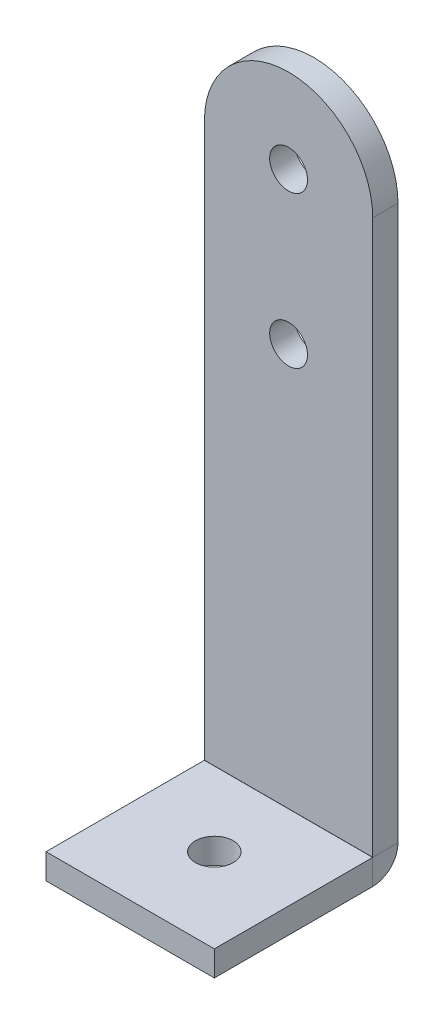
ISO-10303-21;
HEADER;
FILE_DESCRIPTION(('STEP AP214'),'2;1');
FILE_NAME('part.step','',(''),(''),'','','');
FILE_SCHEMA(('AUTOMOTIVE_DESIGN { 1 0 10303 214 1 1 1 1 }'));
ENDSEC;
DATA;
#1=APPLICATION_CONTEXT('core data for automotive mechanical design processes');
#2=APPLICATION_PROTOCOL_DEFINITION('international standard','automotive_design',2000,#1);
#3=PRODUCT_CONTEXT('',#1,'mechanical');
#4=PRODUCT('Part','Part','',(#3));
#5=PRODUCT_RELATED_PRODUCT_CATEGORY('part','',(#4));
#6=PRODUCT_DEFINITION_FORMATION('','',#4);
#7=PRODUCT_DEFINITION_CONTEXT('part definition',#1,'design');
#8=PRODUCT_DEFINITION('design','',#6,#7);
#9=PRODUCT_DEFINITION_SHAPE('','',#8);
#10=(LENGTH_UNIT() NAMED_UNIT(*) SI_UNIT(.MILLI.,.METRE.));
#11=(NAMED_UNIT(*) PLANE_ANGLE_UNIT() SI_UNIT($,.RADIAN.));
#12=(NAMED_UNIT(*) SI_UNIT($,.STERADIAN.) SOLID_ANGLE_UNIT());
#13=UNCERTAINTY_MEASURE_WITH_UNIT(LENGTH_MEASURE(1.E-05),#10,'distance_accuracy_value','');
#14=(GEOMETRIC_REPRESENTATION_CONTEXT(3) GLOBAL_UNCERTAINTY_ASSIGNED_CONTEXT((#13)) GLOBAL_UNIT_ASSIGNED_CONTEXT((#10,
#11,#12)) REPRESENTATION_CONTEXT('',''));
#15=CARTESIAN_POINT('',(0.,0.,0.));
#16=DIRECTION('',(0.,0.,1.));
#17=DIRECTION('',(1.,0.,0.));
#18=AXIS2_PLACEMENT_3D('',#15,#16,#17);
#19=CARTESIAN_POINT('',(10.,21.1759512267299,-65.1759512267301));
#20=DIRECTION('',(0.,1.,0.));
#21=DIRECTION('',(1.,0.,0.));
#22=AXIS2_PLACEMENT_3D('',#19,#20,#21);
#23=PLANE('',#22);
#24=CARTESIAN_POINT('',(10.,21.1759512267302,11.8240487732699));
#25=DIRECTION('',(0.,1.,0.));
#26=DIRECTION('',(1.,0.,0.));
#27=AXIS2_PLACEMENT_3D('',#24,#25,#26);
#28=CIRCLE('',#27,2.25);
#29=CARTESIAN_POINT('',(12.25,21.1759512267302,11.8240487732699));
#30=VERTEX_POINT('',#29);
#31=EDGE_CURVE('E143',#30,#30,#28,.T.);
#32=ORIENTED_EDGE('',*,*,#31,.F.);
#33=EDGE_LOOP('',(#32));
#34=FACE_BOUND('',#33,.T.);
#35=DIRECTION('',(0.,0.,-1.));
#36=VECTOR('',#35,1.);
#37=CARTESIAN_POINT('',(20.,21.1759512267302,21.8240487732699));
#38=LINE('',#37,#36);
#39=CARTESIAN_POINT('',(20.,21.1759512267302,21.8240487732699));
#40=VERTEX_POINT('',#39);
#41=CARTESIAN_POINT('',(20.,21.1759512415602,3.01));
#42=VERTEX_POINT('',#41);
#43=EDGE_CURVE('E40',#40,#42,#38,.T.);
#44=ORIENTED_EDGE('',*,*,#43,.T.);
#45=DIRECTION('',(-1.,0.,0.));
#46=VECTOR('',#45,1.);
#47=CARTESIAN_POINT('',(10.,21.1759512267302,3.01000000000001));
#48=LINE('',#47,#46);
#49=CARTESIAN_POINT('',(0.,21.1759512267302,3.01));
#50=VERTEX_POINT('',#49);
#51=EDGE_CURVE('E113',#42,#50,#48,.T.);
#52=ORIENTED_EDGE('',*,*,#51,.T.);
#53=DIRECTION('',(0.,0.,1.));
#54=VECTOR('',#53,1.);
#55=CARTESIAN_POINT('',(0.,21.1759512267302,21.8240487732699));
#56=LINE('',#55,#54);
#57=CARTESIAN_POINT('',(0.,21.1759512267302,21.8240487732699));
#58=VERTEX_POINT('',#57);
#59=EDGE_CURVE('E132',#50,#58,#56,.T.);
#60=ORIENTED_EDGE('',*,*,#59,.T.);
#61=DIRECTION('',(1.,0.,0.));
#62=VECTOR('',#61,1.);
#63=CARTESIAN_POINT('',(0.,21.1759512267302,21.8240487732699));
#64=LINE('',#63,#62);
#65=EDGE_CURVE('E60',#58,#40,#64,.T.);
#66=ORIENTED_EDGE('',*,*,#65,.T.);
#67=EDGE_LOOP('',(#44,#52,#60,#66));
#68=FACE_BOUND('',#67,.T.);
#69=ADVANCED_FACE('F36',(#34,#68),#23,.T.);
#70=CARTESIAN_POINT('',(10.,18.1759512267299,-65.1759512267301));
#71=DIRECTION('',(0.,1.,0.));
#72=DIRECTION('',(1.,0.,0.));
#73=AXIS2_PLACEMENT_3D('',#70,#71,#72);
#74=PLANE('',#73);
#75=DIRECTION('',(-1.,0.,0.));
#76=VECTOR('',#75,1.);
#77=CARTESIAN_POINT('',(10.,18.1759512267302,3.01));
#78=LINE('',#77,#76);
#79=CARTESIAN_POINT('',(20.,18.1759512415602,3.01));
#80=VERTEX_POINT('',#79);
#81=CARTESIAN_POINT('',(0.,18.1759512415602,3.01));
#82=VERTEX_POINT('',#81);
#83=EDGE_CURVE('E45',#80,#82,#78,.T.);
#84=ORIENTED_EDGE('',*,*,#83,.F.);
#85=DIRECTION('',(0.,0.,-1.));
#86=VECTOR('',#85,1.);
#87=CARTESIAN_POINT('',(20.,18.1759512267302,21.8240487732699));
#88=LINE('',#87,#86);
#89=CARTESIAN_POINT('',(20.,18.1759512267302,21.8240487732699));
#90=VERTEX_POINT('',#89);
#91=EDGE_CURVE('E127',#90,#80,#88,.T.);
#92=ORIENTED_EDGE('',*,*,#91,.F.);
#93=DIRECTION('',(1.,0.,0.));
#94=VECTOR('',#93,1.);
#95=CARTESIAN_POINT('',(0.,18.1759512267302,21.8240487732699));
#96=LINE('',#95,#94);
#97=CARTESIAN_POINT('',(0.,18.1759512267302,21.8240487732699));
#98=VERTEX_POINT('',#97);
#99=EDGE_CURVE('E133',#98,#90,#96,.T.);
#100=ORIENTED_EDGE('',*,*,#99,.F.);
#101=DIRECTION('',(0.,0.,1.));
#102=VECTOR('',#101,1.);
#103=CARTESIAN_POINT('',(0.,18.1759512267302,21.8240487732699));
#104=LINE('',#103,#102);
#105=EDGE_CURVE('E138',#82,#98,#104,.T.);
#106=ORIENTED_EDGE('',*,*,#105,.F.);
#107=EDGE_LOOP('',(#84,#92,#100,#106));
#108=FACE_BOUND('',#107,.T.);
#109=CARTESIAN_POINT('',(10.,18.1759512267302,11.8240487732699));
#110=DIRECTION('',(0.,1.,0.));
#111=DIRECTION('',(1.,0.,0.));
#112=AXIS2_PLACEMENT_3D('',#109,#110,#111);
#113=CIRCLE('',#112,2.25);
#114=CARTESIAN_POINT('',(12.25,18.1759512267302,11.8240487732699));
#115=VERTEX_POINT('',#114);
#116=EDGE_CURVE('E175',#115,#115,#113,.T.);
#117=ORIENTED_EDGE('',*,*,#116,.T.);
#118=EDGE_LOOP('',(#117));
#119=FACE_BOUND('',#118,.T.);
#120=ADVANCED_FACE('F136',(#108,#119),#74,.F.);
#121=CARTESIAN_POINT('',(0.,21.1759512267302,21.8240487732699));
#122=DIRECTION('',(1.,0.,0.));
#123=DIRECTION('',(0.,0.,-1.));
#124=AXIS2_PLACEMENT_3D('',#121,#122,#123);
#125=PLANE('',#124);
#126=DIRECTION('',(0.,1.,0.));
#127=VECTOR('',#126,1.);
#128=CARTESIAN_POINT('',(0.,21.1759512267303,3.01000000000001));
#129=LINE('',#128,#127);
#130=EDGE_CURVE('E12',#82,#50,#129,.T.);
#131=ORIENTED_EDGE('',*,*,#130,.F.);
#132=ORIENTED_EDGE('',*,*,#105,.T.);
#133=DIRECTION('',(0.,-1.,0.));
#134=VECTOR('',#133,1.);
#135=CARTESIAN_POINT('',(0.,21.1759512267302,21.8240487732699));
#136=LINE('',#135,#134);
#137=EDGE_CURVE('E151',#58,#98,#136,.T.);
#138=ORIENTED_EDGE('',*,*,#137,.F.);
#139=ORIENTED_EDGE('',*,*,#59,.F.);
#140=EDGE_LOOP('',(#131,#132,#138,#139));
#141=FACE_BOUND('',#140,.T.);
#142=ADVANCED_FACE('F38',(#141),#125,.F.);
#143=CARTESIAN_POINT('',(0.,21.1759512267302,21.8240487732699));
#144=DIRECTION('',(0.,0.,-1.));
#145=DIRECTION('',(0.,1.,0.));
#146=AXIS2_PLACEMENT_3D('',#143,#144,#145);
#147=PLANE('',#146);
#148=ORIENTED_EDGE('',*,*,#99,.T.);
#149=DIRECTION('',(0.,-1.,0.));
#150=VECTOR('',#149,1.);
#151=CARTESIAN_POINT('',(20.,21.1759512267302,21.8240487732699));
#152=LINE('',#151,#150);
#153=EDGE_CURVE('E129',#40,#90,#152,.T.);
#154=ORIENTED_EDGE('',*,*,#153,.F.);
#155=ORIENTED_EDGE('',*,*,#65,.F.);
#156=ORIENTED_EDGE('',*,*,#137,.T.);
#157=EDGE_LOOP('',(#148,#154,#155,#156));
#158=FACE_BOUND('',#157,.T.);
#159=ADVANCED_FACE('F156',(#158),#147,.F.);
#160=CARTESIAN_POINT('',(20.,21.1759512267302,21.8240487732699));
#161=DIRECTION('',(-1.,0.,0.));
#162=DIRECTION('',(0.,0.,1.));
#163=AXIS2_PLACEMENT_3D('',#160,#161,#162);
#164=PLANE('',#163);
#165=DIRECTION('',(0.,-1.,0.));
#166=VECTOR('',#165,1.);
#167=CARTESIAN_POINT('',(20.,21.1759512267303,3.01000000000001));
#168=LINE('',#167,#166);
#169=EDGE_CURVE('E103',#42,#80,#168,.T.);
#170=ORIENTED_EDGE('',*,*,#169,.F.);
#171=ORIENTED_EDGE('',*,*,#43,.F.);
#172=ORIENTED_EDGE('',*,*,#153,.T.);
#173=ORIENTED_EDGE('',*,*,#91,.T.);
#174=EDGE_LOOP('',(#170,#171,#172,#173));
#175=FACE_BOUND('',#174,.T.);
#176=ADVANCED_FACE('F128',(#175),#164,.F.);
#177=CARTESIAN_POINT('',(10.,21.1759512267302,11.8240487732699));
#178=DIRECTION('',(0.,-1.,0.));
#179=DIRECTION('',(-1.,0.,0.));
#180=AXIS2_PLACEMENT_3D('',#177,#178,#179);
#181=CYLINDRICAL_SURFACE('',#180,2.25);
#182=ORIENTED_EDGE('',*,*,#31,.T.);
#183=EDGE_LOOP('',(#182));
#184=FACE_BOUND('',#183,.T.);
#185=ORIENTED_EDGE('',*,*,#116,.F.);
#186=EDGE_LOOP('',(#185));
#187=FACE_BOUND('',#186,.T.);
#188=ADVANCED_FACE('F163',(#184,#187),#181,.F.);
#189=CARTESIAN_POINT('',(10.,69.,3.));
#190=DIRECTION('',(0.,0.,-1.));
#191=DIRECTION('',(-1.,0.,0.));
#192=AXIS2_PLACEMENT_3D('',#189,#190,#191);
#193=CYLINDRICAL_SURFACE('',#192,2.25);
#194=CARTESIAN_POINT('',(10.,69.,3.));
#195=DIRECTION('',(0.,0.,1.));
#196=DIRECTION('',(1.,0.,0.));
#197=AXIS2_PLACEMENT_3D('',#194,#195,#196);
#198=CIRCLE('',#197,2.25);
#199=CARTESIAN_POINT('',(12.25,69.,3.));
#200=VERTEX_POINT('',#199);
#201=EDGE_CURVE('E182',#200,#200,#198,.T.);
#202=ORIENTED_EDGE('',*,*,#201,.T.);
#203=EDGE_LOOP('',(#202));
#204=FACE_BOUND('',#203,.T.);
#205=CARTESIAN_POINT('',(10.,69.,0.));
#206=DIRECTION('',(0.,0.,1.));
#207=DIRECTION('',(1.,0.,0.));
#208=AXIS2_PLACEMENT_3D('',#205,#206,#207);
#209=CIRCLE('',#208,2.25);
#210=CARTESIAN_POINT('',(12.25,69.,0.));
#211=VERTEX_POINT('',#210);
#212=EDGE_CURVE('E205',#211,#211,#209,.T.);
#213=ORIENTED_EDGE('',*,*,#212,.F.);
#214=EDGE_LOOP('',(#213));
#215=FACE_BOUND('',#214,.T.);
#216=ADVANCED_FACE('F252',(#204,#215),#193,.F.);
#217=CARTESIAN_POINT('',(10.,87.,3.));
#218=DIRECTION('',(0.,0.,-1.));
#219=DIRECTION('',(-1.,0.,0.));
#220=AXIS2_PLACEMENT_3D('',#217,#218,#219);
#221=CYLINDRICAL_SURFACE('',#220,2.25);
#222=CARTESIAN_POINT('',(10.,87.,3.));
#223=DIRECTION('',(0.,0.,1.));
#224=DIRECTION('',(1.,0.,0.));
#225=AXIS2_PLACEMENT_3D('',#222,#223,#224);
#226=CIRCLE('',#225,2.25);
#227=CARTESIAN_POINT('',(12.25,87.,3.));
#228=VERTEX_POINT('',#227);
#229=EDGE_CURVE('E185',#228,#228,#226,.T.);
#230=ORIENTED_EDGE('',*,*,#229,.T.);
#231=EDGE_LOOP('',(#230));
#232=FACE_BOUND('',#231,.T.);
#233=CARTESIAN_POINT('',(10.,87.,0.));
#234=DIRECTION('',(0.,0.,1.));
#235=DIRECTION('',(1.,0.,0.));
#236=AXIS2_PLACEMENT_3D('',#233,#234,#235);
#237=CIRCLE('',#236,2.25);
#238=CARTESIAN_POINT('',(12.25,87.,0.));
#239=VERTEX_POINT('',#238);
#240=EDGE_CURVE('E208',#239,#239,#237,.T.);
#241=ORIENTED_EDGE('',*,*,#240,.F.);
#242=EDGE_LOOP('',(#241));
#243=FACE_BOUND('',#242,.T.);
#244=ADVANCED_FACE('F245',(#232,#243),#221,.F.);
#245=CARTESIAN_POINT('',(10.,87.,3.));
#246=DIRECTION('',(0.,0.,-1.));
#247=DIRECTION('',(-1.,0.,0.));
#248=AXIS2_PLACEMENT_3D('',#245,#246,#247);
#249=CYLINDRICAL_SURFACE('',#248,10.);
#250=CARTESIAN_POINT('',(10.,87.,0.));
#251=DIRECTION('',(0.,0.,1.));
#252=DIRECTION('',(1.,0.,0.));
#253=AXIS2_PLACEMENT_3D('',#250,#251,#252);
#254=CIRCLE('',#253,10.);
#255=CARTESIAN_POINT('',(20.,87.,0.));
#256=VERTEX_POINT('',#255);
#257=CARTESIAN_POINT('',(0.,87.,0.));
#258=VERTEX_POINT('',#257);
#259=EDGE_CURVE('E188',#256,#258,#254,.T.);
#260=ORIENTED_EDGE('',*,*,#259,.T.);
#261=DIRECTION('',(0.,0.,-1.));
#262=VECTOR('',#261,1.);
#263=CARTESIAN_POINT('',(0.,87.,3.));
#264=LINE('',#263,#262);
#265=CARTESIAN_POINT('',(0.,87.,3.));
#266=VERTEX_POINT('',#265);
#267=EDGE_CURVE('E177',#266,#258,#264,.T.);
#268=ORIENTED_EDGE('',*,*,#267,.F.);
#269=CARTESIAN_POINT('',(10.,87.,3.));
#270=DIRECTION('',(0.,0.,1.));
#271=DIRECTION('',(1.,0.,0.));
#272=AXIS2_PLACEMENT_3D('',#269,#270,#271);
#273=CIRCLE('',#272,10.);
#274=CARTESIAN_POINT('',(20.,87.,3.));
#275=VERTEX_POINT('',#274);
#276=EDGE_CURVE('E195',#275,#266,#273,.T.);
#277=ORIENTED_EDGE('',*,*,#276,.F.);
#278=DIRECTION('',(0.,0.,-1.));
#279=VECTOR('',#278,1.);
#280=CARTESIAN_POINT('',(20.,87.,3.));
#281=LINE('',#280,#279);
#282=EDGE_CURVE('E190',#275,#256,#281,.T.);
#283=ORIENTED_EDGE('',*,*,#282,.T.);
#284=EDGE_LOOP('',(#260,#268,#277,#283));
#285=FACE_BOUND('',#284,.T.);
#286=ADVANCED_FACE('F243',(#285),#249,.T.);
#287=CARTESIAN_POINT('',(10.,87.,3.));
#288=DIRECTION('',(0.,0.,1.));
#289=DIRECTION('',(1.,0.,0.));
#290=AXIS2_PLACEMENT_3D('',#287,#288,#289);
#291=PLANE('',#290);
#292=DIRECTION('',(-1.,0.,0.));
#293=VECTOR('',#292,1.);
#294=CARTESIAN_POINT('',(10.,21.1859512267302,3.));
#295=LINE('',#294,#293);
#296=CARTESIAN_POINT('',(20.,21.1859512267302,3.000000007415));
#297=VERTEX_POINT('',#296);
#298=CARTESIAN_POINT('',(0.,21.1859512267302,3.00000001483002));
#299=VERTEX_POINT('',#298);
#300=EDGE_CURVE('E180',#297,#299,#295,.T.);
#301=ORIENTED_EDGE('',*,*,#300,.F.);
#302=DIRECTION('',(0.,1.,0.));
#303=VECTOR('',#302,1.);
#304=CARTESIAN_POINT('',(20.,0.,3.));
#305=LINE('',#304,#303);
#306=EDGE_CURVE('E193',#297,#275,#305,.T.);
#307=ORIENTED_EDGE('',*,*,#306,.T.);
#308=ORIENTED_EDGE('',*,*,#276,.T.);
#309=DIRECTION('',(0.,-1.,0.));
#310=VECTOR('',#309,1.);
#311=CARTESIAN_POINT('',(0.,0.,3.));
#312=LINE('',#311,#310);
#313=EDGE_CURVE('E197',#266,#299,#312,.T.);
#314=ORIENTED_EDGE('',*,*,#313,.T.);
#315=EDGE_LOOP('',(#301,#307,#308,#314));
#316=FACE_BOUND('',#315,.T.);
#317=ORIENTED_EDGE('',*,*,#229,.F.);
#318=EDGE_LOOP('',(#317));
#319=FACE_BOUND('',#318,.T.);
#320=ORIENTED_EDGE('',*,*,#201,.F.);
#321=EDGE_LOOP('',(#320));
#322=FACE_BOUND('',#321,.T.);
#323=ADVANCED_FACE('F239',(#316,#319,#322),#291,.T.);
#324=CARTESIAN_POINT('',(20.,0.,3.));
#325=DIRECTION('',(-1.,0.,0.));
#326=DIRECTION('',(0.,-1.,0.));
#327=AXIS2_PLACEMENT_3D('',#324,#325,#326);
#328=PLANE('',#327);
#329=ORIENTED_EDGE('',*,*,#306,.F.);
#330=DIRECTION('',(0.,0.,-1.));
#331=VECTOR('',#330,1.);
#332=CARTESIAN_POINT('',(20.,21.1859512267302,3.00000000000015));
#333=LINE('',#332,#331);
#334=CARTESIAN_POINT('',(20.,21.1859512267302,0.));
#335=VERTEX_POINT('',#334);
#336=EDGE_CURVE('E200',#297,#335,#333,.T.);
#337=ORIENTED_EDGE('',*,*,#336,.T.);
#338=DIRECTION('',(0.,1.,0.));
#339=VECTOR('',#338,1.);
#340=CARTESIAN_POINT('',(20.,0.,0.));
#341=LINE('',#340,#339);
#342=EDGE_CURVE('E203',#335,#256,#341,.T.);
#343=ORIENTED_EDGE('',*,*,#342,.T.);
#344=ORIENTED_EDGE('',*,*,#282,.F.);
#345=EDGE_LOOP('',(#329,#337,#343,#344));
#346=FACE_BOUND('',#345,.T.);
#347=ADVANCED_FACE('F235',(#346),#328,.F.);
#348=CARTESIAN_POINT('',(10.,87.,0.));
#349=DIRECTION('',(0.,0.,1.));
#350=DIRECTION('',(1.,0.,0.));
#351=AXIS2_PLACEMENT_3D('',#348,#349,#350);
#352=PLANE('',#351);
#353=ORIENTED_EDGE('',*,*,#212,.T.);
#354=EDGE_LOOP('',(#353));
#355=FACE_BOUND('',#354,.T.);
#356=ORIENTED_EDGE('',*,*,#240,.T.);
#357=EDGE_LOOP('',(#356));
#358=FACE_BOUND('',#357,.T.);
#359=ORIENTED_EDGE('',*,*,#342,.F.);
#360=DIRECTION('',(-1.,0.,0.));
#361=VECTOR('',#360,1.);
#362=CARTESIAN_POINT('',(10.,21.1859512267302,0.));
#363=LINE('',#362,#361);
#364=CARTESIAN_POINT('',(0.,21.1859512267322,1.48300182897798E-08));
#365=VERTEX_POINT('',#364);
#366=EDGE_CURVE('E121',#335,#365,#363,.T.);
#367=ORIENTED_EDGE('',*,*,#366,.T.);
#368=DIRECTION('',(0.,-1.,0.));
#369=VECTOR('',#368,1.);
#370=CARTESIAN_POINT('',(0.,0.,0.));
#371=LINE('',#370,#369);
#372=EDGE_CURVE('E212',#258,#365,#371,.T.);
#373=ORIENTED_EDGE('',*,*,#372,.F.);
#374=ORIENTED_EDGE('',*,*,#259,.F.);
#375=EDGE_LOOP('',(#359,#367,#373,#374));
#376=FACE_BOUND('',#375,.T.);
#377=ADVANCED_FACE('F231',(#355,#358,#376),#352,.F.);
#378=CARTESIAN_POINT('',(0.,0.,3.));
#379=DIRECTION('',(1.,0.,0.));
#380=DIRECTION('',(0.,1.,0.));
#381=AXIS2_PLACEMENT_3D('',#378,#379,#380);
#382=PLANE('',#381);
#383=ORIENTED_EDGE('',*,*,#372,.T.);
#384=DIRECTION('',(0.,0.,1.));
#385=VECTOR('',#384,1.);
#386=CARTESIAN_POINT('',(0.,21.1859512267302,3.00000000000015));
#387=LINE('',#386,#385);
#388=EDGE_CURVE('E215',#365,#299,#387,.T.);
#389=ORIENTED_EDGE('',*,*,#388,.T.);
#390=ORIENTED_EDGE('',*,*,#313,.F.);
#391=ORIENTED_EDGE('',*,*,#267,.T.);
#392=EDGE_LOOP('',(#383,#389,#390,#391));
#393=FACE_BOUND('',#392,.T.);
#394=ADVANCED_FACE('F226',(#393),#382,.F.);
#395=CARTESIAN_POINT('',(20.,21.1859512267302,3.00999998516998));
#396=DIRECTION('',(-1.,0.,0.));
#397=DIRECTION('',(0.,0.,1.));
#398=AXIS2_PLACEMENT_3D('',#395,#396,#397);
#399=PLANE('',#398);
#400=ORIENTED_EDGE('',*,*,#169,.T.);
#401=CARTESIAN_POINT('',(20.,21.1859512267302,3.01));
#402=DIRECTION('',(1.,0.,0.));
#403=DIRECTION('',(0.,0.,-1.));
#404=AXIS2_PLACEMENT_3D('',#401,#402,#403);
#405=CIRCLE('',#404,3.00999998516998);
#406=EDGE_CURVE('E106',#80,#335,#405,.T.);
#407=ORIENTED_EDGE('',*,*,#406,.T.);
#408=ORIENTED_EDGE('',*,*,#336,.F.);
#409=CARTESIAN_POINT('',(20.,21.1859512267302,3.00999998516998));
#410=DIRECTION('',(1.,0.,0.));
#411=DIRECTION('',(0.,0.,-1.));
#412=AXIS2_PLACEMENT_3D('',#409,#410,#411);
#413=CIRCLE('',#412,0.00999997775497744);
#414=EDGE_CURVE('E109',#42,#297,#413,.T.);
#415=ORIENTED_EDGE('',*,*,#414,.F.);
#416=EDGE_LOOP('',(#400,#407,#408,#415));
#417=FACE_BOUND('',#416,.T.);
#418=ADVANCED_FACE('F105',(#417),#399,.F.);
#419=CARTESIAN_POINT('',(0.,21.1859512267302,3.00999998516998));
#420=DIRECTION('',(1.,0.,0.));
#421=DIRECTION('',(0.,0.,-1.));
#422=AXIS2_PLACEMENT_3D('',#419,#420,#421);
#423=PLANE('',#422);
#424=CARTESIAN_POINT('',(0.,21.1859512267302,3.01));
#425=DIRECTION('',(1.,0.,0.));
#426=DIRECTION('',(0.,0.,-1.));
#427=AXIS2_PLACEMENT_3D('',#424,#425,#426);
#428=CIRCLE('',#427,3.00999998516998);
#429=EDGE_CURVE('E123',#365,#82,#428,.F.);
#430=ORIENTED_EDGE('',*,*,#429,.T.);
#431=ORIENTED_EDGE('',*,*,#130,.T.);
#432=CARTESIAN_POINT('',(0.,21.1859512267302,3.00999998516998));
#433=DIRECTION('',(-1.,0.,0.));
#434=DIRECTION('',(0.,0.,1.));
#435=AXIS2_PLACEMENT_3D('',#432,#433,#434);
#436=CIRCLE('',#435,0.00999997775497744);
#437=EDGE_CURVE('E53',#299,#50,#436,.T.);
#438=ORIENTED_EDGE('',*,*,#437,.F.);
#439=ORIENTED_EDGE('',*,*,#388,.F.);
#440=EDGE_LOOP('',(#430,#431,#438,#439));
#441=FACE_BOUND('',#440,.T.);
#442=ADVANCED_FACE('F223',(#441),#423,.F.);
#443=CARTESIAN_POINT('',(-10.3623653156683,21.1859512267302,3.01));
#444=DIRECTION('',(1.,0.,0.));
#445=DIRECTION('',(0.,0.,-1.));
#446=AXIS2_PLACEMENT_3D('',#443,#444,#445);
#447=CYLINDRICAL_SURFACE('',#446,0.00999998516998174);
#448=ORIENTED_EDGE('',*,*,#300,.T.);
#449=ORIENTED_EDGE('',*,*,#437,.T.);
#450=ORIENTED_EDGE('',*,*,#51,.F.);
#451=ORIENTED_EDGE('',*,*,#414,.T.);
#452=EDGE_LOOP('',(#448,#449,#450,#451));
#453=FACE_BOUND('',#452,.T.);
#454=ADVANCED_FACE('F237',(#453),#447,.F.);
#455=CARTESIAN_POINT('',(-10.3623653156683,21.1859512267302,3.01));
#456=DIRECTION('',(1.,0.,0.));
#457=DIRECTION('',(0.,0.,-1.));
#458=AXIS2_PLACEMENT_3D('',#455,#456,#457);
#459=CYLINDRICAL_SURFACE('',#458,3.00999998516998);
#460=ORIENTED_EDGE('',*,*,#366,.F.);
#461=ORIENTED_EDGE('',*,*,#406,.F.);
#462=ORIENTED_EDGE('',*,*,#83,.T.);
#463=ORIENTED_EDGE('',*,*,#429,.F.);
#464=EDGE_LOOP('',(#460,#461,#462,#463));
#465=FACE_BOUND('',#464,.T.);
#466=ADVANCED_FACE('F116',(#465),#459,.T.);
#467=CLOSED_SHELL('',(#69,#120,#142,#159,#176,#188,#216,#244,#286,#323,#347,#377,#394,#418,#442,
#454,#466));
#468=MANIFOLD_SOLID_BREP('B2',#467);
#469=ADVANCED_BREP_SHAPE_REPRESENTATION('',(#18,#468),#14);
#470=SHAPE_DEFINITION_REPRESENTATION(#9,#469);
ENDSEC;
END-ISO-10303-21;
